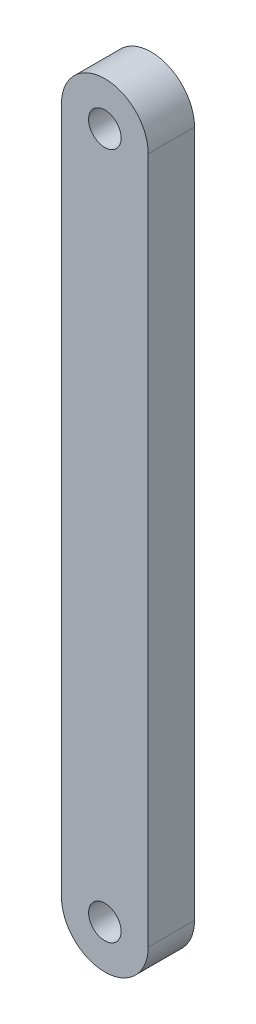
ISO-10303-21;
HEADER;
FILE_DESCRIPTION(('STEP AP214'),'2;1');
FILE_NAME('part.step','',(''),(''),'','','');
FILE_SCHEMA(('AUTOMOTIVE_DESIGN { 1 0 10303 214 1 1 1 1 }'));
ENDSEC;
DATA;
#1=APPLICATION_CONTEXT('core data for automotive mechanical design processes');
#2=APPLICATION_PROTOCOL_DEFINITION('international standard','automotive_design',2000,#1);
#3=PRODUCT_CONTEXT('',#1,'mechanical');
#4=PRODUCT('Part','Part','',(#3));
#5=PRODUCT_RELATED_PRODUCT_CATEGORY('part','',(#4));
#6=PRODUCT_DEFINITION_FORMATION('','',#4);
#7=PRODUCT_DEFINITION_CONTEXT('part definition',#1,'design');
#8=PRODUCT_DEFINITION('design','',#6,#7);
#9=PRODUCT_DEFINITION_SHAPE('','',#8);
#10=(LENGTH_UNIT() NAMED_UNIT(*) SI_UNIT(.MILLI.,.METRE.));
#11=(NAMED_UNIT(*) PLANE_ANGLE_UNIT() SI_UNIT($,.RADIAN.));
#12=(NAMED_UNIT(*) SI_UNIT($,.STERADIAN.) SOLID_ANGLE_UNIT());
#13=UNCERTAINTY_MEASURE_WITH_UNIT(LENGTH_MEASURE(1.E-05),#10,'distance_accuracy_value','');
#14=(GEOMETRIC_REPRESENTATION_CONTEXT(3) GLOBAL_UNCERTAINTY_ASSIGNED_CONTEXT((#13)) GLOBAL_UNIT_ASSIGNED_CONTEXT((#10,
#11,#12)) REPRESENTATION_CONTEXT('',''));
#15=CARTESIAN_POINT('',(0.,0.,0.));
#16=DIRECTION('',(0.,0.,1.));
#17=DIRECTION('',(1.,0.,0.));
#18=AXIS2_PLACEMENT_3D('',#15,#16,#17);
#19=CARTESIAN_POINT('',(0.,47.5,6.4));
#20=DIRECTION('',(0.,0.,1.));
#21=DIRECTION('',(1.,0.,0.));
#22=AXIS2_PLACEMENT_3D('',#19,#20,#21);
#23=PLANE('',#22);
#24=CARTESIAN_POINT('',(0.,95.,6.4));
#25=DIRECTION('',(0.,0.,1.));
#26=DIRECTION('',(1.,0.,0.));
#27=AXIS2_PLACEMENT_3D('',#24,#25,#26);
#28=CIRCLE('',#27,2.25);
#29=CARTESIAN_POINT('',(2.25,95.,6.4));
#30=VERTEX_POINT('',#29);
#31=EDGE_CURVE('E99',#30,#30,#28,.T.);
#32=ORIENTED_EDGE('',*,*,#31,.F.);
#33=EDGE_LOOP('',(#32));
#34=FACE_BOUND('',#33,.T.);
#35=DIRECTION('',(0.,-1.,0.));
#36=VECTOR('',#35,1.);
#37=CARTESIAN_POINT('',(6.,47.5,6.4));
#38=LINE('',#37,#36);
#39=CARTESIAN_POINT('',(6.,95.,6.4));
#40=VERTEX_POINT('',#39);
#41=CARTESIAN_POINT('',(6.,0.,6.4));
#42=VERTEX_POINT('',#41);
#43=EDGE_CURVE('E24',#40,#42,#38,.T.);
#44=ORIENTED_EDGE('',*,*,#43,.F.);
#45=CARTESIAN_POINT('',(0.,95.,6.4));
#46=DIRECTION('',(0.,0.,-1.));
#47=DIRECTION('',(-1.,0.,0.));
#48=AXIS2_PLACEMENT_3D('',#45,#46,#47);
#49=CIRCLE('',#48,6.);
#50=CARTESIAN_POINT('',(-6.,95.,6.4));
#51=VERTEX_POINT('',#50);
#52=EDGE_CURVE('E40',#51,#40,#49,.T.);
#53=ORIENTED_EDGE('',*,*,#52,.F.);
#54=DIRECTION('',(0.,1.,0.));
#55=VECTOR('',#54,1.);
#56=CARTESIAN_POINT('',(-6.,47.5,6.4));
#57=LINE('',#56,#55);
#58=CARTESIAN_POINT('',(-6.,0.,6.4));
#59=VERTEX_POINT('',#58);
#60=EDGE_CURVE('E10',#59,#51,#57,.T.);
#61=ORIENTED_EDGE('',*,*,#60,.F.);
#62=CARTESIAN_POINT('',(0.,0.,6.4));
#63=DIRECTION('',(0.,0.,-1.));
#64=DIRECTION('',(-1.,0.,0.));
#65=AXIS2_PLACEMENT_3D('',#62,#63,#64);
#66=CIRCLE('',#65,6.);
#67=EDGE_CURVE('E80',#42,#59,#66,.T.);
#68=ORIENTED_EDGE('',*,*,#67,.F.);
#69=EDGE_LOOP('',(#44,#53,#61,#68));
#70=FACE_BOUND('',#69,.T.);
#71=CARTESIAN_POINT('',(0.,0.,6.4));
#72=DIRECTION('',(0.,0.,1.));
#73=DIRECTION('',(1.,0.,0.));
#74=AXIS2_PLACEMENT_3D('',#71,#72,#73);
#75=CIRCLE('',#74,2.25);
#76=CARTESIAN_POINT('',(2.25,0.,6.4));
#77=VERTEX_POINT('',#76);
#78=EDGE_CURVE('E81',#77,#77,#75,.T.);
#79=ORIENTED_EDGE('',*,*,#78,.F.);
#80=EDGE_LOOP('',(#79));
#81=FACE_BOUND('',#80,.T.);
#82=ADVANCED_FACE('F16',(#34,#70,#81),#23,.T.);
#83=CARTESIAN_POINT('',(-6.,47.5,0.));
#84=DIRECTION('',(-1.,0.,0.));
#85=DIRECTION('',(0.,0.,1.));
#86=AXIS2_PLACEMENT_3D('',#83,#84,#85);
#87=PLANE('',#86);
#88=DIRECTION('',(0.,0.,1.));
#89=VECTOR('',#88,1.);
#90=CARTESIAN_POINT('',(-6.,0.,0.));
#91=LINE('',#90,#89);
#92=CARTESIAN_POINT('',(-6.,0.,0.));
#93=VERTEX_POINT('',#92);
#94=EDGE_CURVE('E61',#93,#59,#91,.T.);
#95=ORIENTED_EDGE('',*,*,#94,.T.);
#96=ORIENTED_EDGE('',*,*,#60,.T.);
#97=DIRECTION('',(0.,0.,1.));
#98=VECTOR('',#97,1.);
#99=CARTESIAN_POINT('',(-6.,95.,0.));
#100=LINE('',#99,#98);
#101=CARTESIAN_POINT('',(-6.,95.,0.));
#102=VERTEX_POINT('',#101);
#103=EDGE_CURVE('E54',#102,#51,#100,.T.);
#104=ORIENTED_EDGE('',*,*,#103,.F.);
#105=DIRECTION('',(0.,-1.,0.));
#106=VECTOR('',#105,1.);
#107=CARTESIAN_POINT('',(-6.,47.5,0.));
#108=LINE('',#107,#106);
#109=EDGE_CURVE('E75',#102,#93,#108,.T.);
#110=ORIENTED_EDGE('',*,*,#109,.T.);
#111=EDGE_LOOP('',(#95,#96,#104,#110));
#112=FACE_BOUND('',#111,.T.);
#113=ADVANCED_FACE('F68',(#112),#87,.T.);
#114=CARTESIAN_POINT('',(0.,47.5,0.));
#115=DIRECTION('',(0.,0.,-1.));
#116=DIRECTION('',(-1.,0.,0.));
#117=AXIS2_PLACEMENT_3D('',#114,#115,#116);
#118=PLANE('',#117);
#119=CARTESIAN_POINT('',(0.,95.,0.));
#120=DIRECTION('',(0.,0.,-1.));
#121=DIRECTION('',(-1.,0.,0.));
#122=AXIS2_PLACEMENT_3D('',#119,#120,#121);
#123=CIRCLE('',#122,2.25);
#124=CARTESIAN_POINT('',(-2.25,95.,0.));
#125=VERTEX_POINT('',#124);
#126=EDGE_CURVE('E19',#125,#125,#123,.T.);
#127=ORIENTED_EDGE('',*,*,#126,.F.);
#128=EDGE_LOOP('',(#127));
#129=FACE_BOUND('',#128,.T.);
#130=ORIENTED_EDGE('',*,*,#109,.F.);
#131=CARTESIAN_POINT('',(0.,95.,0.));
#132=DIRECTION('',(0.,0.,1.));
#133=DIRECTION('',(1.,0.,0.));
#134=AXIS2_PLACEMENT_3D('',#131,#132,#133);
#135=CIRCLE('',#134,6.);
#136=CARTESIAN_POINT('',(6.,95.,0.));
#137=VERTEX_POINT('',#136);
#138=EDGE_CURVE('E59',#137,#102,#135,.T.);
#139=ORIENTED_EDGE('',*,*,#138,.F.);
#140=DIRECTION('',(0.,1.,0.));
#141=VECTOR('',#140,1.);
#142=CARTESIAN_POINT('',(6.,47.5,0.));
#143=LINE('',#142,#141);
#144=CARTESIAN_POINT('',(6.,0.,0.));
#145=VERTEX_POINT('',#144);
#146=EDGE_CURVE('E85',#145,#137,#143,.T.);
#147=ORIENTED_EDGE('',*,*,#146,.F.);
#148=CARTESIAN_POINT('',(0.,0.,0.));
#149=DIRECTION('',(0.,0.,1.));
#150=DIRECTION('',(1.,0.,0.));
#151=AXIS2_PLACEMENT_3D('',#148,#149,#150);
#152=CIRCLE('',#151,6.);
#153=EDGE_CURVE('E79',#93,#145,#152,.T.);
#154=ORIENTED_EDGE('',*,*,#153,.F.);
#155=EDGE_LOOP('',(#130,#139,#147,#154));
#156=FACE_BOUND('',#155,.T.);
#157=CARTESIAN_POINT('',(0.,0.,0.));
#158=DIRECTION('',(0.,0.,-1.));
#159=DIRECTION('',(-1.,0.,0.));
#160=AXIS2_PLACEMENT_3D('',#157,#158,#159);
#161=CIRCLE('',#160,2.25);
#162=CARTESIAN_POINT('',(-2.25,0.,0.));
#163=VERTEX_POINT('',#162);
#164=EDGE_CURVE('E66',#163,#163,#161,.T.);
#165=ORIENTED_EDGE('',*,*,#164,.F.);
#166=EDGE_LOOP('',(#165));
#167=FACE_BOUND('',#166,.T.);
#168=ADVANCED_FACE('F108',(#129,#156,#167),#118,.T.);
#169=CARTESIAN_POINT('',(6.,47.5,0.));
#170=DIRECTION('',(1.,0.,0.));
#171=DIRECTION('',(0.,0.,-1.));
#172=AXIS2_PLACEMENT_3D('',#169,#170,#171);
#173=PLANE('',#172);
#174=ORIENTED_EDGE('',*,*,#146,.T.);
#175=DIRECTION('',(0.,0.,1.));
#176=VECTOR('',#175,1.);
#177=CARTESIAN_POINT('',(6.,95.,0.));
#178=LINE('',#177,#176);
#179=EDGE_CURVE('E62',#137,#40,#178,.T.);
#180=ORIENTED_EDGE('',*,*,#179,.T.);
#181=ORIENTED_EDGE('',*,*,#43,.T.);
#182=DIRECTION('',(0.,0.,1.));
#183=VECTOR('',#182,1.);
#184=CARTESIAN_POINT('',(6.,0.,0.));
#185=LINE('',#184,#183);
#186=EDGE_CURVE('E78',#145,#42,#185,.T.);
#187=ORIENTED_EDGE('',*,*,#186,.F.);
#188=EDGE_LOOP('',(#174,#180,#181,#187));
#189=FACE_BOUND('',#188,.T.);
#190=ADVANCED_FACE('F115',(#189),#173,.T.);
#191=CARTESIAN_POINT('',(0.,0.,0.));
#192=DIRECTION('',(0.,0.,1.));
#193=DIRECTION('',(1.,0.,0.));
#194=AXIS2_PLACEMENT_3D('',#191,#192,#193);
#195=CYLINDRICAL_SURFACE('',#194,6.);
#196=ORIENTED_EDGE('',*,*,#94,.F.);
#197=ORIENTED_EDGE('',*,*,#153,.T.);
#198=ORIENTED_EDGE('',*,*,#186,.T.);
#199=ORIENTED_EDGE('',*,*,#67,.T.);
#200=EDGE_LOOP('',(#196,#197,#198,#199));
#201=FACE_BOUND('',#200,.T.);
#202=ADVANCED_FACE('F77',(#201),#195,.T.);
#203=CARTESIAN_POINT('',(0.,0.,-0.1));
#204=DIRECTION('',(0.,0.,1.));
#205=DIRECTION('',(1.,0.,0.));
#206=AXIS2_PLACEMENT_3D('',#203,#204,#205);
#207=CYLINDRICAL_SURFACE('',#206,2.25);
#208=ORIENTED_EDGE('',*,*,#78,.T.);
#209=EDGE_LOOP('',(#208));
#210=FACE_BOUND('',#209,.T.);
#211=ORIENTED_EDGE('',*,*,#164,.T.);
#212=EDGE_LOOP('',(#211));
#213=FACE_BOUND('',#212,.T.);
#214=ADVANCED_FACE('F123',(#210,#213),#207,.F.);
#215=CARTESIAN_POINT('',(0.,95.,0.));
#216=DIRECTION('',(0.,0.,1.));
#217=DIRECTION('',(1.,0.,0.));
#218=AXIS2_PLACEMENT_3D('',#215,#216,#217);
#219=CYLINDRICAL_SURFACE('',#218,6.);
#220=ORIENTED_EDGE('',*,*,#138,.T.);
#221=ORIENTED_EDGE('',*,*,#103,.T.);
#222=ORIENTED_EDGE('',*,*,#52,.T.);
#223=ORIENTED_EDGE('',*,*,#179,.F.);
#224=EDGE_LOOP('',(#220,#221,#222,#223));
#225=FACE_BOUND('',#224,.T.);
#226=ADVANCED_FACE('F57',(#225),#219,.T.);
#227=CARTESIAN_POINT('',(0.,95.,-0.1));
#228=DIRECTION('',(0.,0.,1.));
#229=DIRECTION('',(1.,0.,0.));
#230=AXIS2_PLACEMENT_3D('',#227,#228,#229);
#231=CYLINDRICAL_SURFACE('',#230,2.25);
#232=ORIENTED_EDGE('',*,*,#31,.T.);
#233=EDGE_LOOP('',(#232));
#234=FACE_BOUND('',#233,.T.);
#235=ORIENTED_EDGE('',*,*,#126,.T.);
#236=EDGE_LOOP('',(#235));
#237=FACE_BOUND('',#236,.T.);
#238=ADVANCED_FACE('F110',(#234,#237),#231,.F.);
#239=CLOSED_SHELL('',(#82,#113,#168,#190,#202,#214,#226,#238));
#240=MANIFOLD_SOLID_BREP('B1',#239);
#241=ADVANCED_BREP_SHAPE_REPRESENTATION('',(#18,#240),#14);
#242=SHAPE_DEFINITION_REPRESENTATION(#9,#241);
ENDSEC;
END-ISO-10303-21;
